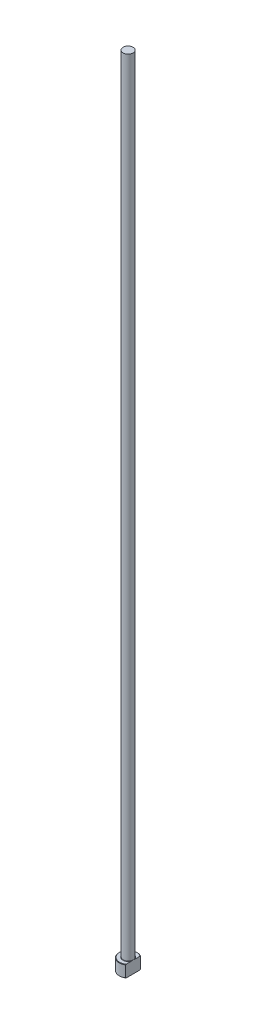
from build123d import *
from build123d.topology import SkipClean

# Parameters (mm, degrees)
CHAMFER1_SIZE    = 0.2
FILLET1_R        = 0.2
KEYED_HEAD_DEPTH = 401.050621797


with BuildPart() as part:
    # Sketch1 → Revolve1 (revolve)
    with BuildSketch(Plane.XY, mode=Mode.PRIVATE) as revolve1_sk:
        Polygon((0, 0), (-4.5, 0), (-4.5, 6), (-2.5, 6), (-2.5, 400), (0, 400), align=None)
    revolve(revolve1_sk.sketch.rotate(Axis((0, 259.958771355, 0), (0, -1, 0)), 270), axis=Axis((0, 259.958771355, 0), (0, -1, 0)))

    # Chamfer1
    chamfer1_edges = [part.edges().sort_by_distance(p)[0] for p in [
        (0, 6, -4.5),
        (0, 0, -4.5),
    ]]
    chamfer(chamfer1_edges, length=CHAMFER1_SIZE)

    # Fillet1
    fillet1_edges = [part.edges().sort_by_distance(p)[0] for p in [
        (0, 6, -2.5),
    ]]
    fillet(fillet1_edges, radius=FILLET1_R)

    # Sketch2 → KEYED HEAD (cut, through all)
    with SkipClean():  # the faces are left unmerged after this step: merging them gives an invalid solid
        with BuildSketch(Plane(origin=(0, 0, 0), x_dir=(1, 0, 0), z_dir=(0, 1, 0))):
            with BuildLine():
                Line((2.5, -3.741657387), (2.5, 3.741657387))
                ThreePointArc((2.5, 3.741657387), (4.5, 0), (2.5, -3.741657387))
            make_face()
        extrude(amount=KEYED_HEAD_DEPTH, mode=Mode.SUBTRACT)


solid = part.part
